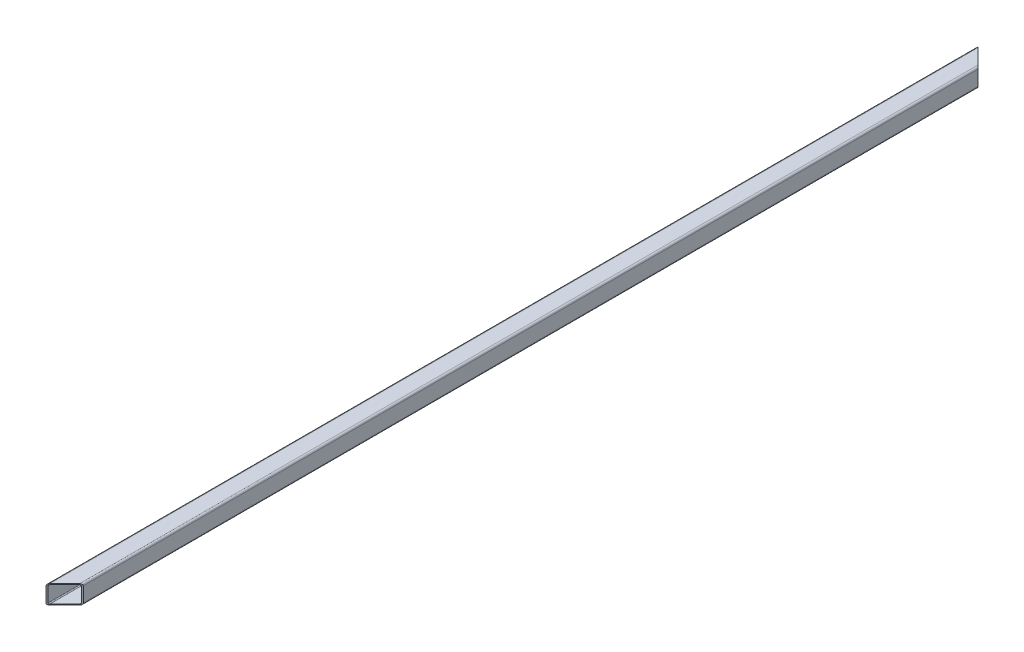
ISO-10303-21;
HEADER;
FILE_DESCRIPTION(('STEP AP214'),'2;1');
FILE_NAME('part.step','',(''),(''),'','','');
FILE_SCHEMA(('AUTOMOTIVE_DESIGN { 1 0 10303 214 1 1 1 1 }'));
ENDSEC;
DATA;
#1=APPLICATION_CONTEXT('core data for automotive mechanical design processes');
#2=APPLICATION_PROTOCOL_DEFINITION('international standard','automotive_design',2000,#1);
#3=PRODUCT_CONTEXT('',#1,'mechanical');
#4=PRODUCT('Part','Part','',(#3));
#5=PRODUCT_RELATED_PRODUCT_CATEGORY('part','',(#4));
#6=PRODUCT_DEFINITION_FORMATION('','',#4);
#7=PRODUCT_DEFINITION_CONTEXT('part definition',#1,'design');
#8=PRODUCT_DEFINITION('design','',#6,#7);
#9=PRODUCT_DEFINITION_SHAPE('','',#8);
#10=(LENGTH_UNIT() NAMED_UNIT(*) SI_UNIT(.MILLI.,.METRE.));
#11=(NAMED_UNIT(*) PLANE_ANGLE_UNIT() SI_UNIT($,.RADIAN.));
#12=(NAMED_UNIT(*) SI_UNIT($,.STERADIAN.) SOLID_ANGLE_UNIT());
#13=UNCERTAINTY_MEASURE_WITH_UNIT(LENGTH_MEASURE(1.E-05),#10,'distance_accuracy_value','');
#14=(GEOMETRIC_REPRESENTATION_CONTEXT(3) GLOBAL_UNCERTAINTY_ASSIGNED_CONTEXT((#13)) GLOBAL_UNIT_ASSIGNED_CONTEXT((#10,
#11,#12)) REPRESENTATION_CONTEXT('',''));
#15=CARTESIAN_POINT('',(0.,0.,0.));
#16=DIRECTION('',(0.,0.,1.));
#17=DIRECTION('',(1.,0.,0.));
#18=AXIS2_PLACEMENT_3D('',#15,#16,#17);
#19=CARTESIAN_POINT('',(6.,-54.,1500.));
#20=DIRECTION('',(0.,0.,-1.));
#21=DIRECTION('',(-1.,0.,0.));
#22=AXIS2_PLACEMENT_3D('',#19,#20,#21);
#23=CYLINDRICAL_SURFACE('',#22,6.);
#24=DIRECTION('',(0.,0.,-1.));
#25=VECTOR('',#24,1.);
#26=CARTESIAN_POINT('',(6.,-60.,1500.));
#27=LINE('',#26,#25);
#28=CARTESIAN_POINT('',(6.,-60.,1494.));
#29=VERTEX_POINT('',#28);
#30=CARTESIAN_POINT('',(6.00000000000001,-60.,-1494.));
#31=VERTEX_POINT('',#30);
#32=EDGE_CURVE('E42',#29,#31,#27,.T.);
#33=ORIENTED_EDGE('',*,*,#32,.F.);
#34=CARTESIAN_POINT('',(6.,-54.,1494.));
#35=DIRECTION('',(-0.707106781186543,0.,-0.707106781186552));
#36=DIRECTION('',(0.707106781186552,0.,-0.707106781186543));
#37=AXIS2_PLACEMENT_3D('',#34,#35,#36);
#38=ELLIPSE('',#37,8.48528137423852,6.);
#39=CARTESIAN_POINT('',(-3.88578058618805E-13,-54.,1500.));
#40=VERTEX_POINT('',#39);
#41=EDGE_CURVE('E162',#29,#40,#38,.T.);
#42=ORIENTED_EDGE('',*,*,#41,.T.);
#43=DIRECTION('',(0.,0.,-1.));
#44=VECTOR('',#43,1.);
#45=CARTESIAN_POINT('',(0.,-54.,1500.));
#46=LINE('',#45,#44);
#47=CARTESIAN_POINT('',(0.,-54.,-1500.));
#48=VERTEX_POINT('',#47);
#49=EDGE_CURVE('E149',#40,#48,#46,.T.);
#50=ORIENTED_EDGE('',*,*,#49,.T.);
#51=CARTESIAN_POINT('',(6.,-54.,-1494.));
#52=DIRECTION('',(0.707106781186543,0.,-0.707106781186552));
#53=DIRECTION('',(-0.707106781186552,0.,-0.707106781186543));
#54=AXIS2_PLACEMENT_3D('',#51,#52,#53);
#55=ELLIPSE('',#54,8.48528137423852,6.);
#56=EDGE_CURVE('E192',#31,#48,#55,.T.);
#57=ORIENTED_EDGE('',*,*,#56,.F.);
#58=EDGE_LOOP('',(#33,#42,#50,#57));
#59=FACE_BOUND('',#58,.T.);
#60=ADVANCED_FACE('F35',(#59),#23,.T.);
#61=CARTESIAN_POINT('',(6.,-60.,1500.));
#62=DIRECTION('',(0.,1.,0.));
#63=DIRECTION('',(0.,0.,1.));
#64=AXIS2_PLACEMENT_3D('',#61,#62,#63);
#65=PLANE('',#64);
#66=DIRECTION('',(0.,0.,-1.));
#67=VECTOR('',#66,1.);
#68=CARTESIAN_POINT('',(54.,-60.,1500.));
#69=LINE('',#68,#67);
#70=CARTESIAN_POINT('',(54.,-60.,1446.));
#71=VERTEX_POINT('',#70);
#72=CARTESIAN_POINT('',(54.,-60.,-1446.));
#73=VERTEX_POINT('',#72);
#74=EDGE_CURVE('E184',#71,#73,#69,.T.);
#75=ORIENTED_EDGE('',*,*,#74,.F.);
#76=DIRECTION('',(-0.707106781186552,0.,0.707106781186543));
#77=VECTOR('',#76,1.);
#78=CARTESIAN_POINT('',(2.99999999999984,-60.,1497.));
#79=LINE('',#78,#77);
#80=EDGE_CURVE('E49',#71,#29,#79,.T.);
#81=ORIENTED_EDGE('',*,*,#80,.T.);
#82=ORIENTED_EDGE('',*,*,#32,.T.);
#83=DIRECTION('',(-0.707106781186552,0.,-0.707106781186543));
#84=VECTOR('',#83,1.);
#85=CARTESIAN_POINT('',(1503.,-60.,2.99999999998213));
#86=LINE('',#85,#84);
#87=EDGE_CURVE('E188',#73,#31,#86,.T.);
#88=ORIENTED_EDGE('',*,*,#87,.F.);
#89=EDGE_LOOP('',(#75,#81,#82,#88));
#90=FACE_BOUND('',#89,.T.);
#91=ADVANCED_FACE('F187',(#90),#65,.F.);
#92=CARTESIAN_POINT('',(54.,-54.,1500.));
#93=DIRECTION('',(0.,0.,-1.));
#94=DIRECTION('',(-1.,0.,0.));
#95=AXIS2_PLACEMENT_3D('',#92,#93,#94);
#96=CYLINDRICAL_SURFACE('',#95,5.99999999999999);
#97=DIRECTION('',(0.,0.,-1.));
#98=VECTOR('',#97,1.);
#99=CARTESIAN_POINT('',(60.,-54.,1500.));
#100=LINE('',#99,#98);
#101=CARTESIAN_POINT('',(60.,-54.,1440.));
#102=VERTEX_POINT('',#101);
#103=CARTESIAN_POINT('',(60.0000000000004,-54.,-1440.));
#104=VERTEX_POINT('',#103);
#105=EDGE_CURVE('E182',#102,#104,#100,.T.);
#106=ORIENTED_EDGE('',*,*,#105,.F.);
#107=CARTESIAN_POINT('',(54.,-54.,1446.));
#108=DIRECTION('',(-0.707106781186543,0.,-0.707106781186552));
#109=DIRECTION('',(0.707106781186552,0.,-0.707106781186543));
#110=AXIS2_PLACEMENT_3D('',#107,#108,#109);
#111=ELLIPSE('',#110,8.48528137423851,5.99999999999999);
#112=EDGE_CURVE('E57',#102,#71,#111,.T.);
#113=ORIENTED_EDGE('',*,*,#112,.T.);
#114=ORIENTED_EDGE('',*,*,#74,.T.);
#115=CARTESIAN_POINT('',(54.,-54.,-1446.));
#116=DIRECTION('',(0.707106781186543,0.,-0.707106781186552));
#117=DIRECTION('',(-0.707106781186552,0.,-0.707106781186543));
#118=AXIS2_PLACEMENT_3D('',#115,#116,#117);
#119=ELLIPSE('',#118,8.48528137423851,5.99999999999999);
#120=EDGE_CURVE('E195',#104,#73,#119,.T.);
#121=ORIENTED_EDGE('',*,*,#120,.F.);
#122=EDGE_LOOP('',(#106,#113,#114,#121));
#123=FACE_BOUND('',#122,.T.);
#124=ADVANCED_FACE('F334',(#123),#96,.T.);
#125=CARTESIAN_POINT('',(60.,-54.,1500.));
#126=DIRECTION('',(-1.,0.,0.));
#127=DIRECTION('',(0.,0.,1.));
#128=AXIS2_PLACEMENT_3D('',#125,#126,#127);
#129=PLANE('',#128);
#130=DIRECTION('',(0.,0.,-1.));
#131=VECTOR('',#130,1.);
#132=CARTESIAN_POINT('',(60.,-6.,1500.));
#133=LINE('',#132,#131);
#134=CARTESIAN_POINT('',(60.,-6.,1440.));
#135=VERTEX_POINT('',#134);
#136=CARTESIAN_POINT('',(60.,-6.,-1440.));
#137=VERTEX_POINT('',#136);
#138=EDGE_CURVE('E180',#135,#137,#133,.T.);
#139=ORIENTED_EDGE('',*,*,#138,.F.);
#140=DIRECTION('',(0.,-1.,0.));
#141=VECTOR('',#140,1.);
#142=CARTESIAN_POINT('',(60.0000000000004,0.,1440.));
#143=LINE('',#142,#141);
#144=EDGE_CURVE('E312',#135,#102,#143,.T.);
#145=ORIENTED_EDGE('',*,*,#144,.T.);
#146=ORIENTED_EDGE('',*,*,#105,.T.);
#147=DIRECTION('',(0.,-1.,0.));
#148=VECTOR('',#147,1.);
#149=CARTESIAN_POINT('',(60.0000000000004,0.,-1440.));
#150=LINE('',#149,#148);
#151=EDGE_CURVE('E248',#137,#104,#150,.T.);
#152=ORIENTED_EDGE('',*,*,#151,.F.);
#153=EDGE_LOOP('',(#139,#145,#146,#152));
#154=FACE_BOUND('',#153,.T.);
#155=ADVANCED_FACE('F254',(#154),#129,.F.);
#156=CARTESIAN_POINT('',(54.,-6.,1500.));
#157=DIRECTION('',(0.,0.,-1.));
#158=DIRECTION('',(-1.,0.,0.));
#159=AXIS2_PLACEMENT_3D('',#156,#157,#158);
#160=CYLINDRICAL_SURFACE('',#159,5.99999999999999);
#161=DIRECTION('',(0.,0.,-1.));
#162=VECTOR('',#161,1.);
#163=CARTESIAN_POINT('',(54.,0.,1500.));
#164=LINE('',#163,#162);
#165=CARTESIAN_POINT('',(54.,0.,1446.));
#166=VERTEX_POINT('',#165);
#167=CARTESIAN_POINT('',(53.9999999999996,0.,-1446.));
#168=VERTEX_POINT('',#167);
#169=EDGE_CURVE('E178',#166,#168,#164,.T.);
#170=ORIENTED_EDGE('',*,*,#169,.F.);
#171=CARTESIAN_POINT('',(54.,-6.,1446.));
#172=DIRECTION('',(-0.707106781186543,0.,-0.707106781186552));
#173=DIRECTION('',(0.707106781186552,0.,-0.707106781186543));
#174=AXIS2_PLACEMENT_3D('',#171,#172,#173);
#175=ELLIPSE('',#174,8.48528137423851,5.99999999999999);
#176=EDGE_CURVE('E306',#166,#135,#175,.T.);
#177=ORIENTED_EDGE('',*,*,#176,.T.);
#178=ORIENTED_EDGE('',*,*,#138,.T.);
#179=CARTESIAN_POINT('',(54.,-6.,-1446.));
#180=DIRECTION('',(0.707106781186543,0.,-0.707106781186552));
#181=DIRECTION('',(-0.707106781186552,0.,-0.707106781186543));
#182=AXIS2_PLACEMENT_3D('',#179,#180,#181);
#183=ELLIPSE('',#182,8.48528137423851,5.99999999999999);
#184=EDGE_CURVE('E243',#168,#137,#183,.T.);
#185=ORIENTED_EDGE('',*,*,#184,.F.);
#186=EDGE_LOOP('',(#170,#177,#178,#185));
#187=FACE_BOUND('',#186,.T.);
#188=ADVANCED_FACE('F310',(#187),#160,.T.);
#189=CARTESIAN_POINT('',(6.,0.,1500.));
#190=DIRECTION('',(0.,-1.,0.));
#191=DIRECTION('',(0.,0.,-1.));
#192=AXIS2_PLACEMENT_3D('',#189,#190,#191);
#193=PLANE('',#192);
#194=DIRECTION('',(0.,0.,-1.));
#195=VECTOR('',#194,1.);
#196=CARTESIAN_POINT('',(6.,0.,1500.));
#197=LINE('',#196,#195);
#198=CARTESIAN_POINT('',(6.,0.,1494.));
#199=VERTEX_POINT('',#198);
#200=CARTESIAN_POINT('',(6.,0.,-1494.));
#201=VERTEX_POINT('',#200);
#202=EDGE_CURVE('E176',#199,#201,#197,.T.);
#203=ORIENTED_EDGE('',*,*,#202,.F.);
#204=DIRECTION('',(0.707106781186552,0.,-0.707106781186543));
#205=VECTOR('',#204,1.);
#206=CARTESIAN_POINT('',(-3.88578058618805E-13,0.,1500.));
#207=LINE('',#206,#205);
#208=EDGE_CURVE('E311',#199,#166,#207,.T.);
#209=ORIENTED_EDGE('',*,*,#208,.T.);
#210=ORIENTED_EDGE('',*,*,#169,.T.);
#211=DIRECTION('',(0.707106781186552,0.,0.707106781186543));
#212=VECTOR('',#211,1.);
#213=CARTESIAN_POINT('',(-3.88578058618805E-13,0.,-1500.));
#214=LINE('',#213,#212);
#215=EDGE_CURVE('E164',#201,#168,#214,.T.);
#216=ORIENTED_EDGE('',*,*,#215,.F.);
#217=EDGE_LOOP('',(#203,#209,#210,#216));
#218=FACE_BOUND('',#217,.T.);
#219=ADVANCED_FACE('F317',(#218),#193,.F.);
#220=CARTESIAN_POINT('',(6.,-6.,1500.));
#221=DIRECTION('',(0.,0.,-1.));
#222=DIRECTION('',(-1.,0.,0.));
#223=AXIS2_PLACEMENT_3D('',#220,#221,#222);
#224=CYLINDRICAL_SURFACE('',#223,6.);
#225=DIRECTION('',(0.,0.,-1.));
#226=VECTOR('',#225,1.);
#227=CARTESIAN_POINT('',(0.,-6.,1500.));
#228=LINE('',#227,#226);
#229=CARTESIAN_POINT('',(0.,-6.,1500.));
#230=VERTEX_POINT('',#229);
#231=CARTESIAN_POINT('',(-3.88578058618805E-13,-6.,-1500.));
#232=VERTEX_POINT('',#231);
#233=EDGE_CURVE('E159',#230,#232,#228,.T.);
#234=ORIENTED_EDGE('',*,*,#233,.F.);
#235=CARTESIAN_POINT('',(6.,-6.,1494.));
#236=DIRECTION('',(-0.707106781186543,0.,-0.707106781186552));
#237=DIRECTION('',(0.707106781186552,0.,-0.707106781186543));
#238=AXIS2_PLACEMENT_3D('',#235,#236,#237);
#239=ELLIPSE('',#238,8.48528137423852,6.);
#240=EDGE_CURVE('E168',#230,#199,#239,.T.);
#241=ORIENTED_EDGE('',*,*,#240,.T.);
#242=ORIENTED_EDGE('',*,*,#202,.T.);
#243=CARTESIAN_POINT('',(6.,-6.,-1494.));
#244=DIRECTION('',(0.707106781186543,0.,-0.707106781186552));
#245=DIRECTION('',(-0.707106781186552,0.,-0.707106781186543));
#246=AXIS2_PLACEMENT_3D('',#243,#244,#245);
#247=ELLIPSE('',#246,8.48528137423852,6.);
#248=EDGE_CURVE('E232',#232,#201,#247,.T.);
#249=ORIENTED_EDGE('',*,*,#248,.F.);
#250=EDGE_LOOP('',(#234,#241,#242,#249));
#251=FACE_BOUND('',#250,.T.);
#252=ADVANCED_FACE('F320',(#251),#224,.T.);
#253=CARTESIAN_POINT('',(6.,-54.,1500.));
#254=DIRECTION('',(0.,0.,-1.));
#255=DIRECTION('',(-1.,0.,0.));
#256=AXIS2_PLACEMENT_3D('',#253,#254,#255);
#257=CYLINDRICAL_SURFACE('',#256,3.);
#258=CARTESIAN_POINT('',(6.,-54.,1494.));
#259=DIRECTION('',(-0.707106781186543,0.,-0.707106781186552));
#260=DIRECTION('',(0.707106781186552,0.,-0.707106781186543));
#261=AXIS2_PLACEMENT_3D('',#258,#259,#260);
#262=ELLIPSE('',#261,4.24264068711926,3.);
#263=CARTESIAN_POINT('',(6.,-57.,1494.));
#264=VERTEX_POINT('',#263);
#265=CARTESIAN_POINT('',(3.,-54.,1497.));
#266=VERTEX_POINT('',#265);
#267=EDGE_CURVE('E224',#264,#266,#262,.T.);
#268=ORIENTED_EDGE('',*,*,#267,.F.);
#269=DIRECTION('',(0.,0.,-1.));
#270=VECTOR('',#269,1.);
#271=CARTESIAN_POINT('',(6.,-57.,1500.));
#272=LINE('',#271,#270);
#273=CARTESIAN_POINT('',(6.00000000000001,-57.,-1494.));
#274=VERTEX_POINT('',#273);
#275=EDGE_CURVE('E170',#264,#274,#272,.T.);
#276=ORIENTED_EDGE('',*,*,#275,.T.);
#277=CARTESIAN_POINT('',(6.,-54.,-1494.));
#278=DIRECTION('',(0.707106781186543,0.,-0.707106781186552));
#279=DIRECTION('',(-0.707106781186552,0.,-0.707106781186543));
#280=AXIS2_PLACEMENT_3D('',#277,#278,#279);
#281=ELLIPSE('',#280,4.24264068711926,3.);
#282=CARTESIAN_POINT('',(3.,-54.,-1497.));
#283=VERTEX_POINT('',#282);
#284=EDGE_CURVE('E222',#274,#283,#281,.T.);
#285=ORIENTED_EDGE('',*,*,#284,.T.);
#286=DIRECTION('',(0.,0.,-1.));
#287=VECTOR('',#286,1.);
#288=CARTESIAN_POINT('',(3.,-54.,1500.));
#289=LINE('',#288,#287);
#290=EDGE_CURVE('E197',#266,#283,#289,.T.);
#291=ORIENTED_EDGE('',*,*,#290,.F.);
#292=EDGE_LOOP('',(#268,#276,#285,#291));
#293=FACE_BOUND('',#292,.T.);
#294=ADVANCED_FACE('F220',(#293),#257,.F.);
#295=CARTESIAN_POINT('',(6.,-57.,1500.));
#296=DIRECTION('',(0.,1.,0.));
#297=DIRECTION('',(0.,0.,1.));
#298=AXIS2_PLACEMENT_3D('',#295,#296,#297);
#299=PLANE('',#298);
#300=DIRECTION('',(-0.707106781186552,0.,0.707106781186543));
#301=VECTOR('',#300,1.);
#302=CARTESIAN_POINT('',(2.99999999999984,-57.,1497.));
#303=LINE('',#302,#301);
#304=CARTESIAN_POINT('',(54.,-57.,1446.));
#305=VERTEX_POINT('',#304);
#306=EDGE_CURVE('E302',#305,#264,#303,.T.);
#307=ORIENTED_EDGE('',*,*,#306,.F.);
#308=DIRECTION('',(0.,0.,-1.));
#309=VECTOR('',#308,1.);
#310=CARTESIAN_POINT('',(54.,-57.,1500.));
#311=LINE('',#310,#309);
#312=CARTESIAN_POINT('',(54.,-57.,-1446.));
#313=VERTEX_POINT('',#312);
#314=EDGE_CURVE('E211',#305,#313,#311,.T.);
#315=ORIENTED_EDGE('',*,*,#314,.T.);
#316=DIRECTION('',(-0.707106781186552,0.,-0.707106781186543));
#317=VECTOR('',#316,1.);
#318=CARTESIAN_POINT('',(1503.,-57.,2.99999999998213));
#319=LINE('',#318,#317);
#320=EDGE_CURVE('E229',#313,#274,#319,.T.);
#321=ORIENTED_EDGE('',*,*,#320,.T.);
#322=ORIENTED_EDGE('',*,*,#275,.F.);
#323=EDGE_LOOP('',(#307,#315,#321,#322));
#324=FACE_BOUND('',#323,.T.);
#325=ADVANCED_FACE('F234',(#324),#299,.T.);
#326=CARTESIAN_POINT('',(54.,-54.,1500.));
#327=DIRECTION('',(0.,0.,-1.));
#328=DIRECTION('',(-1.,0.,0.));
#329=AXIS2_PLACEMENT_3D('',#326,#327,#328);
#330=CYLINDRICAL_SURFACE('',#329,2.99999999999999);
#331=CARTESIAN_POINT('',(54.,-54.,1446.));
#332=DIRECTION('',(-0.707106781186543,0.,-0.707106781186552));
#333=DIRECTION('',(0.707106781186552,0.,-0.707106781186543));
#334=AXIS2_PLACEMENT_3D('',#331,#332,#333);
#335=ELLIPSE('',#334,4.24264068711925,2.99999999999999);
#336=CARTESIAN_POINT('',(57.,-54.,1443.));
#337=VERTEX_POINT('',#336);
#338=EDGE_CURVE('E299',#337,#305,#335,.T.);
#339=ORIENTED_EDGE('',*,*,#338,.F.);
#340=DIRECTION('',(0.,0.,-1.));
#341=VECTOR('',#340,1.);
#342=CARTESIAN_POINT('',(57.,-54.,1500.));
#343=LINE('',#342,#341);
#344=CARTESIAN_POINT('',(57.,-54.,-1443.));
#345=VERTEX_POINT('',#344);
#346=EDGE_CURVE('E210',#337,#345,#343,.T.);
#347=ORIENTED_EDGE('',*,*,#346,.T.);
#348=CARTESIAN_POINT('',(54.,-54.,-1446.));
#349=DIRECTION('',(0.707106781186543,0.,-0.707106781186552));
#350=DIRECTION('',(-0.707106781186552,0.,-0.707106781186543));
#351=AXIS2_PLACEMENT_3D('',#348,#349,#350);
#352=ELLIPSE('',#351,4.24264068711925,2.99999999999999);
#353=EDGE_CURVE('E235',#345,#313,#352,.T.);
#354=ORIENTED_EDGE('',*,*,#353,.T.);
#355=ORIENTED_EDGE('',*,*,#314,.F.);
#356=EDGE_LOOP('',(#339,#347,#354,#355));
#357=FACE_BOUND('',#356,.T.);
#358=ADVANCED_FACE('F370',(#357),#330,.F.);
#359=CARTESIAN_POINT('',(57.,-54.,1500.));
#360=DIRECTION('',(-1.,0.,0.));
#361=DIRECTION('',(0.,-1.,0.));
#362=AXIS2_PLACEMENT_3D('',#359,#360,#361);
#363=PLANE('',#362);
#364=DIRECTION('',(0.,-1.,0.));
#365=VECTOR('',#364,1.);
#366=CARTESIAN_POINT('',(57.,-54.,1443.));
#367=LINE('',#366,#365);
#368=CARTESIAN_POINT('',(57.,-6.,1443.));
#369=VERTEX_POINT('',#368);
#370=EDGE_CURVE('E292',#369,#337,#367,.T.);
#371=ORIENTED_EDGE('',*,*,#370,.F.);
#372=DIRECTION('',(0.,0.,-1.));
#373=VECTOR('',#372,1.);
#374=CARTESIAN_POINT('',(57.,-6.,1500.));
#375=LINE('',#374,#373);
#376=CARTESIAN_POINT('',(57.,-6.,-1443.));
#377=VERTEX_POINT('',#376);
#378=EDGE_CURVE('E208',#369,#377,#375,.T.);
#379=ORIENTED_EDGE('',*,*,#378,.T.);
#380=DIRECTION('',(0.,-1.,0.));
#381=VECTOR('',#380,1.);
#382=CARTESIAN_POINT('',(57.,-53.9999999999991,-1443.));
#383=LINE('',#382,#381);
#384=EDGE_CURVE('E237',#377,#345,#383,.T.);
#385=ORIENTED_EDGE('',*,*,#384,.T.);
#386=ORIENTED_EDGE('',*,*,#346,.F.);
#387=EDGE_LOOP('',(#371,#379,#385,#386));
#388=FACE_BOUND('',#387,.T.);
#389=ADVANCED_FACE('F271',(#388),#363,.T.);
#390=CARTESIAN_POINT('',(54.,-6.,1500.));
#391=DIRECTION('',(0.,0.,-1.));
#392=DIRECTION('',(-1.,0.,0.));
#393=AXIS2_PLACEMENT_3D('',#390,#391,#392);
#394=CYLINDRICAL_SURFACE('',#393,3.);
#395=CARTESIAN_POINT('',(54.,-6.,1446.));
#396=DIRECTION('',(-0.707106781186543,0.,-0.707106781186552));
#397=DIRECTION('',(0.707106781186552,0.,-0.707106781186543));
#398=AXIS2_PLACEMENT_3D('',#395,#396,#397);
#399=ELLIPSE('',#398,4.24264068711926,3.);
#400=CARTESIAN_POINT('',(54.,-3.,1446.));
#401=VERTEX_POINT('',#400);
#402=EDGE_CURVE('E280',#401,#369,#399,.T.);
#403=ORIENTED_EDGE('',*,*,#402,.F.);
#404=DIRECTION('',(0.,0.,-1.));
#405=VECTOR('',#404,1.);
#406=CARTESIAN_POINT('',(54.,-3.,1500.));
#407=LINE('',#406,#405);
#408=CARTESIAN_POINT('',(53.9999999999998,-3.,-1446.));
#409=VERTEX_POINT('',#408);
#410=EDGE_CURVE('E206',#401,#409,#407,.T.);
#411=ORIENTED_EDGE('',*,*,#410,.T.);
#412=CARTESIAN_POINT('',(54.,-6.,-1446.));
#413=DIRECTION('',(0.707106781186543,0.,-0.707106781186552));
#414=DIRECTION('',(-0.707106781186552,0.,-0.707106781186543));
#415=AXIS2_PLACEMENT_3D('',#412,#413,#414);
#416=ELLIPSE('',#415,4.24264068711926,3.);
#417=EDGE_CURVE('E265',#409,#377,#416,.T.);
#418=ORIENTED_EDGE('',*,*,#417,.T.);
#419=ORIENTED_EDGE('',*,*,#378,.F.);
#420=EDGE_LOOP('',(#403,#411,#418,#419));
#421=FACE_BOUND('',#420,.T.);
#422=ADVANCED_FACE('F277',(#421),#394,.F.);
#423=CARTESIAN_POINT('',(6.,-3.,1500.));
#424=DIRECTION('',(0.,-1.,0.));
#425=DIRECTION('',(0.,0.,-1.));
#426=AXIS2_PLACEMENT_3D('',#423,#424,#425);
#427=PLANE('',#426);
#428=DIRECTION('',(0.707106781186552,0.,-0.707106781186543));
#429=VECTOR('',#428,1.);
#430=CARTESIAN_POINT('',(2.99999999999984,-3.,1497.));
#431=LINE('',#430,#429);
#432=CARTESIAN_POINT('',(6.,-3.,1494.));
#433=VERTEX_POINT('',#432);
#434=EDGE_CURVE('E284',#433,#401,#431,.T.);
#435=ORIENTED_EDGE('',*,*,#434,.F.);
#436=DIRECTION('',(0.,0.,-1.));
#437=VECTOR('',#436,1.);
#438=CARTESIAN_POINT('',(6.,-3.,1500.));
#439=LINE('',#438,#437);
#440=CARTESIAN_POINT('',(6.,-3.,-1494.));
#441=VERTEX_POINT('',#440);
#442=EDGE_CURVE('E204',#433,#441,#439,.T.);
#443=ORIENTED_EDGE('',*,*,#442,.T.);
#444=DIRECTION('',(0.707106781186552,0.,0.707106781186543));
#445=VECTOR('',#444,1.);
#446=CARTESIAN_POINT('',(1503.,-3.,2.99999999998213));
#447=LINE('',#446,#445);
#448=EDGE_CURVE('E259',#441,#409,#447,.T.);
#449=ORIENTED_EDGE('',*,*,#448,.T.);
#450=ORIENTED_EDGE('',*,*,#410,.F.);
#451=EDGE_LOOP('',(#435,#443,#449,#450));
#452=FACE_BOUND('',#451,.T.);
#453=ADVANCED_FACE('F283',(#452),#427,.T.);
#454=CARTESIAN_POINT('',(6.,-6.,1500.));
#455=DIRECTION('',(0.,0.,-1.));
#456=DIRECTION('',(-1.,0.,0.));
#457=AXIS2_PLACEMENT_3D('',#454,#455,#456);
#458=CYLINDRICAL_SURFACE('',#457,3.);
#459=CARTESIAN_POINT('',(6.,-6.,1494.));
#460=DIRECTION('',(-0.707106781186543,0.,-0.707106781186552));
#461=DIRECTION('',(0.707106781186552,0.,-0.707106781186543));
#462=AXIS2_PLACEMENT_3D('',#459,#460,#461);
#463=ELLIPSE('',#462,4.24264068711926,3.);
#464=CARTESIAN_POINT('',(3.,-6.,1497.));
#465=VERTEX_POINT('',#464);
#466=EDGE_CURVE('E290',#465,#433,#463,.T.);
#467=ORIENTED_EDGE('',*,*,#466,.F.);
#468=DIRECTION('',(0.,0.,-1.));
#469=VECTOR('',#468,1.);
#470=CARTESIAN_POINT('',(3.,-6.,1500.));
#471=LINE('',#470,#469);
#472=CARTESIAN_POINT('',(3.,-6.,-1497.));
#473=VERTEX_POINT('',#472);
#474=EDGE_CURVE('E199',#465,#473,#471,.T.);
#475=ORIENTED_EDGE('',*,*,#474,.T.);
#476=CARTESIAN_POINT('',(6.,-6.,-1494.));
#477=DIRECTION('',(0.707106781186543,0.,-0.707106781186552));
#478=DIRECTION('',(-0.707106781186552,0.,-0.707106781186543));
#479=AXIS2_PLACEMENT_3D('',#476,#477,#478);
#480=ELLIPSE('',#479,4.24264068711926,3.);
#481=EDGE_CURVE('E256',#473,#441,#480,.T.);
#482=ORIENTED_EDGE('',*,*,#481,.T.);
#483=ORIENTED_EDGE('',*,*,#442,.F.);
#484=EDGE_LOOP('',(#467,#475,#482,#483));
#485=FACE_BOUND('',#484,.T.);
#486=ADVANCED_FACE('F404',(#485),#458,.F.);
#487=CARTESIAN_POINT('',(3.,-54.,1500.));
#488=DIRECTION('',(1.,0.,0.));
#489=DIRECTION('',(0.,0.,-1.));
#490=AXIS2_PLACEMENT_3D('',#487,#488,#489);
#491=PLANE('',#490);
#492=DIRECTION('',(0.,1.,0.));
#493=VECTOR('',#492,1.);
#494=CARTESIAN_POINT('',(3.,-54.,1497.));
#495=LINE('',#494,#493);
#496=EDGE_CURVE('E294',#266,#465,#495,.T.);
#497=ORIENTED_EDGE('',*,*,#496,.F.);
#498=ORIENTED_EDGE('',*,*,#290,.T.);
#499=DIRECTION('',(0.,1.,0.));
#500=VECTOR('',#499,1.);
#501=CARTESIAN_POINT('',(3.,-54.,-1497.));
#502=LINE('',#501,#500);
#503=EDGE_CURVE('E11',#283,#473,#502,.T.);
#504=ORIENTED_EDGE('',*,*,#503,.T.);
#505=ORIENTED_EDGE('',*,*,#474,.F.);
#506=EDGE_LOOP('',(#497,#498,#504,#505));
#507=FACE_BOUND('',#506,.T.);
#508=ADVANCED_FACE('F413',(#507),#491,.T.);
#509=CARTESIAN_POINT('',(0.,-54.,1500.));
#510=DIRECTION('',(1.,0.,0.));
#511=DIRECTION('',(0.,0.,-1.));
#512=AXIS2_PLACEMENT_3D('',#509,#510,#511);
#513=PLANE('',#512);
#514=DIRECTION('',(0.,-1.,0.));
#515=VECTOR('',#514,1.);
#516=CARTESIAN_POINT('',(0.,-54.,-1500.));
#517=LINE('',#516,#515);
#518=EDGE_CURVE('E156',#232,#48,#517,.T.);
#519=ORIENTED_EDGE('',*,*,#518,.T.);
#520=ORIENTED_EDGE('',*,*,#49,.F.);
#521=DIRECTION('',(0.,-1.,0.));
#522=VECTOR('',#521,1.);
#523=CARTESIAN_POINT('',(0.,-54.,1500.));
#524=LINE('',#523,#522);
#525=EDGE_CURVE('E154',#230,#40,#524,.T.);
#526=ORIENTED_EDGE('',*,*,#525,.F.);
#527=ORIENTED_EDGE('',*,*,#233,.T.);
#528=EDGE_LOOP('',(#519,#520,#526,#527));
#529=FACE_BOUND('',#528,.T.);
#530=ADVANCED_FACE('F151',(#529),#513,.F.);
#531=CARTESIAN_POINT('',(-3.88578058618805E-13,0.,-1500.));
#532=DIRECTION('',(0.707106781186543,0.,-0.707106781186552));
#533=DIRECTION('',(-0.707106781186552,0.,-0.707106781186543));
#534=AXIS2_PLACEMENT_3D('',#531,#532,#533);
#535=PLANE('',#534);
#536=ORIENTED_EDGE('',*,*,#284,.F.);
#537=ORIENTED_EDGE('',*,*,#320,.F.);
#538=ORIENTED_EDGE('',*,*,#353,.F.);
#539=ORIENTED_EDGE('',*,*,#384,.F.);
#540=ORIENTED_EDGE('',*,*,#417,.F.);
#541=ORIENTED_EDGE('',*,*,#448,.F.);
#542=ORIENTED_EDGE('',*,*,#481,.F.);
#543=ORIENTED_EDGE('',*,*,#503,.F.);
#544=EDGE_LOOP('',(#536,#537,#538,#539,#540,#541,#542,#543));
#545=FACE_BOUND('',#544,.T.);
#546=ORIENTED_EDGE('',*,*,#87,.T.);
#547=ORIENTED_EDGE('',*,*,#56,.T.);
#548=ORIENTED_EDGE('',*,*,#518,.F.);
#549=ORIENTED_EDGE('',*,*,#248,.T.);
#550=ORIENTED_EDGE('',*,*,#215,.T.);
#551=ORIENTED_EDGE('',*,*,#184,.T.);
#552=ORIENTED_EDGE('',*,*,#151,.T.);
#553=ORIENTED_EDGE('',*,*,#120,.T.);
#554=EDGE_LOOP('',(#546,#547,#548,#549,#550,#551,#552,#553));
#555=FACE_BOUND('',#554,.T.);
#556=ADVANCED_FACE('F191',(#545,#555),#535,.T.);
#557=CARTESIAN_POINT('',(-3.88578058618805E-13,0.,1500.));
#558=DIRECTION('',(-0.707106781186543,0.,-0.707106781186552));
#559=DIRECTION('',(-0.707106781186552,0.,0.707106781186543));
#560=AXIS2_PLACEMENT_3D('',#557,#558,#559);
#561=PLANE('',#560);
#562=ORIENTED_EDGE('',*,*,#306,.T.);
#563=ORIENTED_EDGE('',*,*,#267,.T.);
#564=ORIENTED_EDGE('',*,*,#496,.T.);
#565=ORIENTED_EDGE('',*,*,#466,.T.);
#566=ORIENTED_EDGE('',*,*,#434,.T.);
#567=ORIENTED_EDGE('',*,*,#402,.T.);
#568=ORIENTED_EDGE('',*,*,#370,.T.);
#569=ORIENTED_EDGE('',*,*,#338,.T.);
#570=EDGE_LOOP('',(#562,#563,#564,#565,#566,#567,#568,#569));
#571=FACE_BOUND('',#570,.T.);
#572=ORIENTED_EDGE('',*,*,#41,.F.);
#573=ORIENTED_EDGE('',*,*,#80,.F.);
#574=ORIENTED_EDGE('',*,*,#112,.F.);
#575=ORIENTED_EDGE('',*,*,#144,.F.);
#576=ORIENTED_EDGE('',*,*,#176,.F.);
#577=ORIENTED_EDGE('',*,*,#208,.F.);
#578=ORIENTED_EDGE('',*,*,#240,.F.);
#579=ORIENTED_EDGE('',*,*,#525,.T.);
#580=EDGE_LOOP('',(#572,#573,#574,#575,#576,#577,#578,#579));
#581=FACE_BOUND('',#580,.T.);
#582=ADVANCED_FACE('F166',(#571,#581),#561,.F.);
#583=CLOSED_SHELL('',(#60,#91,#124,#155,#188,#219,#252,#294,#325,#358,#389,#422,#453,#486,#508,
#530,#556,#582));
#584=MANIFOLD_SOLID_BREP('B2',#583);
#585=ADVANCED_BREP_SHAPE_REPRESENTATION('',(#18,#584),#14);
#586=SHAPE_DEFINITION_REPRESENTATION(#9,#585);
ENDSEC;
END-ISO-10303-21;
